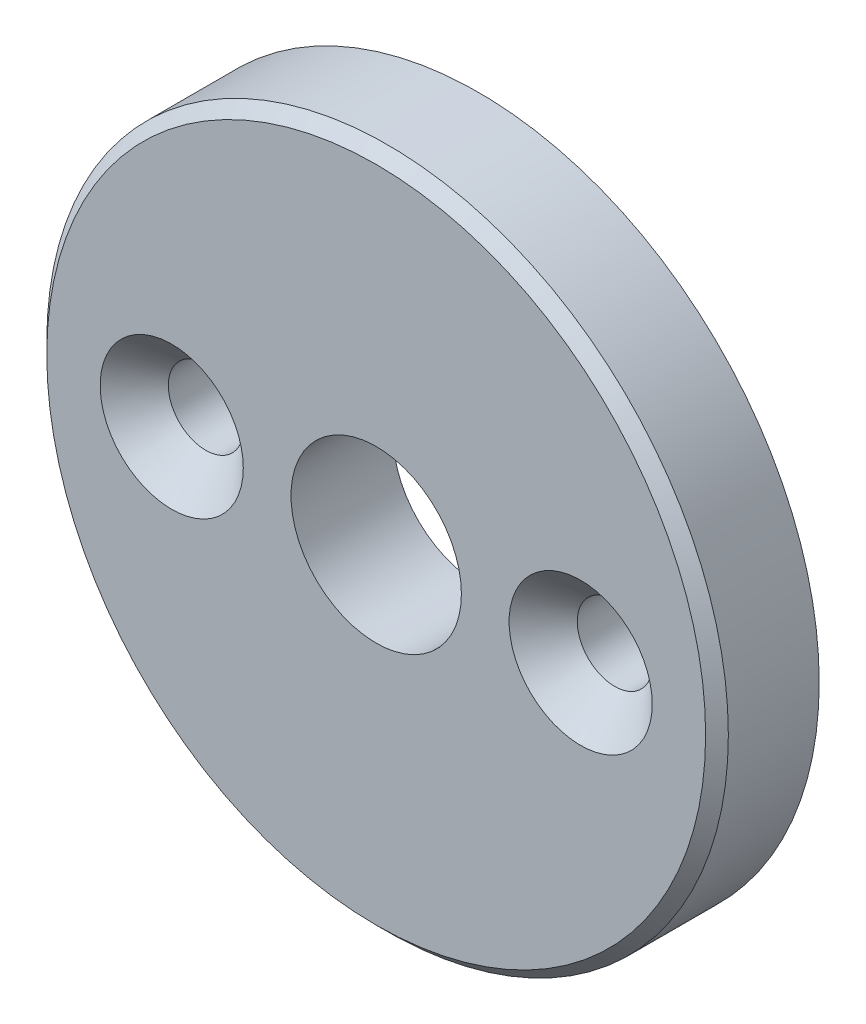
ISO-10303-21;
HEADER;
FILE_DESCRIPTION(('STEP AP214'),'2;1');
FILE_NAME('part.step','',(''),(''),'','','');
FILE_SCHEMA(('AUTOMOTIVE_DESIGN { 1 0 10303 214 1 1 1 1 }'));
ENDSEC;
DATA;
#1=APPLICATION_CONTEXT('core data for automotive mechanical design processes');
#2=APPLICATION_PROTOCOL_DEFINITION('international standard','automotive_design',2000,#1);
#3=PRODUCT_CONTEXT('',#1,'mechanical');
#4=PRODUCT('Part','Part','',(#3));
#5=PRODUCT_RELATED_PRODUCT_CATEGORY('part','',(#4));
#6=PRODUCT_DEFINITION_FORMATION('','',#4);
#7=PRODUCT_DEFINITION_CONTEXT('part definition',#1,'design');
#8=PRODUCT_DEFINITION('design','',#6,#7);
#9=PRODUCT_DEFINITION_SHAPE('','',#8);
#10=(LENGTH_UNIT() NAMED_UNIT(*) SI_UNIT(.MILLI.,.METRE.));
#11=(NAMED_UNIT(*) PLANE_ANGLE_UNIT() SI_UNIT($,.RADIAN.));
#12=(NAMED_UNIT(*) SI_UNIT($,.STERADIAN.) SOLID_ANGLE_UNIT());
#13=UNCERTAINTY_MEASURE_WITH_UNIT(LENGTH_MEASURE(1.E-05),#10,'distance_accuracy_value','');
#14=(GEOMETRIC_REPRESENTATION_CONTEXT(3) GLOBAL_UNCERTAINTY_ASSIGNED_CONTEXT((#13)) GLOBAL_UNIT_ASSIGNED_CONTEXT((#10,
#11,#12)) REPRESENTATION_CONTEXT('',''));
#15=CARTESIAN_POINT('',(0.,0.,0.));
#16=DIRECTION('',(0.,0.,1.));
#17=DIRECTION('',(1.,0.,0.));
#18=AXIS2_PLACEMENT_3D('',#15,#16,#17);
#19=CARTESIAN_POINT('',(0.,0.,9.));
#20=DIRECTION('',(0.,0.,1.));
#21=DIRECTION('',(1.,0.,0.));
#22=AXIS2_PLACEMENT_3D('',#19,#20,#21);
#23=PLANE('',#22);
#24=CARTESIAN_POINT('',(18.,0.,9.));
#25=DIRECTION('',(0.,0.,1.));
#26=DIRECTION('',(1.,0.,0.));
#27=AXIS2_PLACEMENT_3D('',#24,#25,#26);
#28=CIRCLE('',#27,6.3);
#29=CARTESIAN_POINT('',(24.3,0.,9.));
#30=VERTEX_POINT('',#29);
#31=EDGE_CURVE('E57',#30,#30,#28,.T.);
#32=ORIENTED_EDGE('',*,*,#31,.F.);
#33=EDGE_LOOP('',(#32));
#34=FACE_BOUND('',#33,.T.);
#35=CARTESIAN_POINT('',(-18.,0.,9.));
#36=DIRECTION('',(0.,0.,1.));
#37=DIRECTION('',(1.,0.,0.));
#38=AXIS2_PLACEMENT_3D('',#35,#36,#37);
#39=CIRCLE('',#38,6.3);
#40=CARTESIAN_POINT('',(-11.7,0.,9.));
#41=VERTEX_POINT('',#40);
#42=EDGE_CURVE('E48',#41,#41,#39,.T.);
#43=ORIENTED_EDGE('',*,*,#42,.F.);
#44=EDGE_LOOP('',(#43));
#45=FACE_BOUND('',#44,.T.);
#46=CARTESIAN_POINT('',(0.,0.,9.));
#47=DIRECTION('',(0.,0.,1.));
#48=DIRECTION('',(1.,0.,0.));
#49=AXIS2_PLACEMENT_3D('',#46,#47,#48);
#50=CIRCLE('',#49,29.);
#51=CARTESIAN_POINT('',(29.,0.,9.));
#52=VERTEX_POINT('',#51);
#53=EDGE_CURVE('E32',#52,#52,#50,.T.);
#54=ORIENTED_EDGE('',*,*,#53,.T.);
#55=EDGE_LOOP('',(#54));
#56=FACE_BOUND('',#55,.T.);
#57=CARTESIAN_POINT('',(0.,0.,9.));
#58=DIRECTION('',(0.,0.,1.));
#59=DIRECTION('',(1.,0.,0.));
#60=AXIS2_PLACEMENT_3D('',#57,#58,#59);
#61=CIRCLE('',#60,7.5);
#62=CARTESIAN_POINT('',(7.5,0.,9.));
#63=VERTEX_POINT('',#62);
#64=EDGE_CURVE('E40',#63,#63,#61,.T.);
#65=ORIENTED_EDGE('',*,*,#64,.F.);
#66=EDGE_LOOP('',(#65));
#67=FACE_BOUND('',#66,.T.);
#68=ADVANCED_FACE('F25',(#34,#45,#56,#67),#23,.T.);
#69=CARTESIAN_POINT('',(0.,0.,0.));
#70=DIRECTION('',(0.,0.,1.));
#71=DIRECTION('',(1.,0.,0.));
#72=AXIS2_PLACEMENT_3D('',#69,#70,#71);
#73=PLANE('',#72);
#74=CARTESIAN_POINT('',(18.,0.,0.));
#75=DIRECTION('',(0.,0.,1.));
#76=DIRECTION('',(1.,0.,0.));
#77=AXIS2_PLACEMENT_3D('',#74,#75,#76);
#78=CIRCLE('',#77,3.3);
#79=CARTESIAN_POINT('',(21.3,0.,0.));
#80=VERTEX_POINT('',#79);
#81=EDGE_CURVE('E63',#80,#80,#78,.T.);
#82=ORIENTED_EDGE('',*,*,#81,.T.);
#83=EDGE_LOOP('',(#82));
#84=FACE_BOUND('',#83,.T.);
#85=CARTESIAN_POINT('',(-18.,0.,0.));
#86=DIRECTION('',(0.,0.,1.));
#87=DIRECTION('',(1.,0.,0.));
#88=AXIS2_PLACEMENT_3D('',#85,#86,#87);
#89=CIRCLE('',#88,3.3);
#90=CARTESIAN_POINT('',(-14.7,0.,0.));
#91=VERTEX_POINT('',#90);
#92=EDGE_CURVE('E54',#91,#91,#89,.T.);
#93=ORIENTED_EDGE('',*,*,#92,.T.);
#94=EDGE_LOOP('',(#93));
#95=FACE_BOUND('',#94,.T.);
#96=CARTESIAN_POINT('',(0.,0.,0.));
#97=DIRECTION('',(0.,0.,1.));
#98=DIRECTION('',(1.,0.,0.));
#99=AXIS2_PLACEMENT_3D('',#96,#97,#98);
#100=CIRCLE('',#99,30.);
#101=CARTESIAN_POINT('',(30.,0.,0.));
#102=VERTEX_POINT('',#101);
#103=EDGE_CURVE('E36',#102,#102,#100,.T.);
#104=ORIENTED_EDGE('',*,*,#103,.F.);
#105=EDGE_LOOP('',(#104));
#106=FACE_BOUND('',#105,.T.);
#107=CARTESIAN_POINT('',(0.,0.,0.));
#108=DIRECTION('',(0.,0.,1.));
#109=DIRECTION('',(1.,0.,0.));
#110=AXIS2_PLACEMENT_3D('',#107,#108,#109);
#111=CIRCLE('',#110,7.5);
#112=CARTESIAN_POINT('',(7.5,0.,0.));
#113=VERTEX_POINT('',#112);
#114=EDGE_CURVE('E45',#113,#113,#111,.T.);
#115=ORIENTED_EDGE('',*,*,#114,.T.);
#116=EDGE_LOOP('',(#115));
#117=FACE_BOUND('',#116,.T.);
#118=ADVANCED_FACE('F67',(#84,#95,#106,#117),#73,.F.);
#119=CARTESIAN_POINT('',(0.,0.,9.));
#120=DIRECTION('',(0.,0.,-1.));
#121=DIRECTION('',(-1.,0.,0.));
#122=AXIS2_PLACEMENT_3D('',#119,#120,#121);
#123=CYLINDRICAL_SURFACE('',#122,30.);
#124=CARTESIAN_POINT('',(0.,0.,8.00000000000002));
#125=DIRECTION('',(0.,0.,1.));
#126=DIRECTION('',(1.,0.,0.));
#127=AXIS2_PLACEMENT_3D('',#124,#125,#126);
#128=CIRCLE('',#127,30.);
#129=CARTESIAN_POINT('',(30.,0.,8.00000000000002));
#130=VERTEX_POINT('',#129);
#131=EDGE_CURVE('E10',#130,#130,#128,.F.);
#132=ORIENTED_EDGE('',*,*,#131,.T.);
#133=EDGE_LOOP('',(#132));
#134=FACE_BOUND('',#133,.T.);
#135=ORIENTED_EDGE('',*,*,#103,.T.);
#136=EDGE_LOOP('',(#135));
#137=FACE_BOUND('',#136,.T.);
#138=ADVANCED_FACE('F27',(#134,#137),#123,.T.);
#139=CARTESIAN_POINT('',(0.,0.,9.));
#140=DIRECTION('',(0.,0.,-1.));
#141=DIRECTION('',(-1.,0.,0.));
#142=AXIS2_PLACEMENT_3D('',#139,#140,#141);
#143=CYLINDRICAL_SURFACE('',#142,7.5);
#144=ORIENTED_EDGE('',*,*,#64,.T.);
#145=EDGE_LOOP('',(#144));
#146=FACE_BOUND('',#145,.T.);
#147=ORIENTED_EDGE('',*,*,#114,.F.);
#148=EDGE_LOOP('',(#147));
#149=FACE_BOUND('',#148,.T.);
#150=ADVANCED_FACE('F89',(#146,#149),#143,.F.);
#151=CARTESIAN_POINT('',(0.,0.,9.));
#152=DIRECTION('',(0.,0.,-1.));
#153=DIRECTION('',(-1.,0.,0.));
#154=AXIS2_PLACEMENT_3D('',#151,#152,#153);
#155=CONICAL_SURFACE('',#154,29.,0.785398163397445);
#156=ORIENTED_EDGE('',*,*,#131,.F.);
#157=EDGE_LOOP('',(#156));
#158=FACE_BOUND('',#157,.T.);
#159=ORIENTED_EDGE('',*,*,#53,.F.);
#160=EDGE_LOOP('',(#159));
#161=FACE_BOUND('',#160,.T.);
#162=ADVANCED_FACE('F92',(#158,#161),#155,.T.);
#163=CARTESIAN_POINT('',(-18.,0.,9.));
#164=DIRECTION('',(0.,0.,1.));
#165=DIRECTION('',(1.,0.,0.));
#166=AXIS2_PLACEMENT_3D('',#163,#164,#165);
#167=CONICAL_SURFACE('',#166,6.3,0.785398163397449);
#168=CARTESIAN_POINT('',(-18.,0.,6.));
#169=DIRECTION('',(0.,0.,1.));
#170=DIRECTION('',(1.,0.,0.));
#171=AXIS2_PLACEMENT_3D('',#168,#169,#170);
#172=CIRCLE('',#171,3.3);
#173=CARTESIAN_POINT('',(-14.7,0.,6.));
#174=VERTEX_POINT('',#173);
#175=EDGE_CURVE('E51',#174,#174,#172,.T.);
#176=ORIENTED_EDGE('',*,*,#175,.F.);
#177=EDGE_LOOP('',(#176));
#178=FACE_BOUND('',#177,.T.);
#179=ORIENTED_EDGE('',*,*,#42,.T.);
#180=EDGE_LOOP('',(#179));
#181=FACE_BOUND('',#180,.T.);
#182=ADVANCED_FACE('F104',(#178,#181),#167,.F.);
#183=CARTESIAN_POINT('',(-18.,0.,9.));
#184=DIRECTION('',(0.,0.,1.));
#185=DIRECTION('',(1.,0.,0.));
#186=AXIS2_PLACEMENT_3D('',#183,#184,#185);
#187=CYLINDRICAL_SURFACE('',#186,3.3);
#188=ORIENTED_EDGE('',*,*,#92,.F.);
#189=EDGE_LOOP('',(#188));
#190=FACE_BOUND('',#189,.T.);
#191=ORIENTED_EDGE('',*,*,#175,.T.);
#192=EDGE_LOOP('',(#191));
#193=FACE_BOUND('',#192,.T.);
#194=ADVANCED_FACE('F79',(#190,#193),#187,.F.);
#195=CARTESIAN_POINT('',(18.,0.,9.));
#196=DIRECTION('',(0.,0.,1.));
#197=DIRECTION('',(1.,0.,0.));
#198=AXIS2_PLACEMENT_3D('',#195,#196,#197);
#199=CONICAL_SURFACE('',#198,6.3,0.785398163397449);
#200=CARTESIAN_POINT('',(18.,0.,6.));
#201=DIRECTION('',(0.,0.,1.));
#202=DIRECTION('',(1.,0.,0.));
#203=AXIS2_PLACEMENT_3D('',#200,#201,#202);
#204=CIRCLE('',#203,3.3);
#205=CARTESIAN_POINT('',(21.3,0.,6.));
#206=VERTEX_POINT('',#205);
#207=EDGE_CURVE('E60',#206,#206,#204,.T.);
#208=ORIENTED_EDGE('',*,*,#207,.F.);
#209=EDGE_LOOP('',(#208));
#210=FACE_BOUND('',#209,.T.);
#211=ORIENTED_EDGE('',*,*,#31,.T.);
#212=EDGE_LOOP('',(#211));
#213=FACE_BOUND('',#212,.T.);
#214=ADVANCED_FACE('F73',(#210,#213),#199,.F.);
#215=CARTESIAN_POINT('',(18.,0.,9.));
#216=DIRECTION('',(0.,0.,1.));
#217=DIRECTION('',(1.,0.,0.));
#218=AXIS2_PLACEMENT_3D('',#215,#216,#217);
#219=CYLINDRICAL_SURFACE('',#218,3.3);
#220=ORIENTED_EDGE('',*,*,#81,.F.);
#221=EDGE_LOOP('',(#220));
#222=FACE_BOUND('',#221,.T.);
#223=ORIENTED_EDGE('',*,*,#207,.T.);
#224=EDGE_LOOP('',(#223));
#225=FACE_BOUND('',#224,.T.);
#226=ADVANCED_FACE('F70',(#222,#225),#219,.F.);
#227=CLOSED_SHELL('',(#68,#118,#138,#150,#162,#182,#194,#214,#226));
#228=MANIFOLD_SOLID_BREP('B2',#227);
#229=ADVANCED_BREP_SHAPE_REPRESENTATION('',(#18,#228),#14);
#230=SHAPE_DEFINITION_REPRESENTATION(#9,#229);
ENDSEC;
END-ISO-10303-21;
